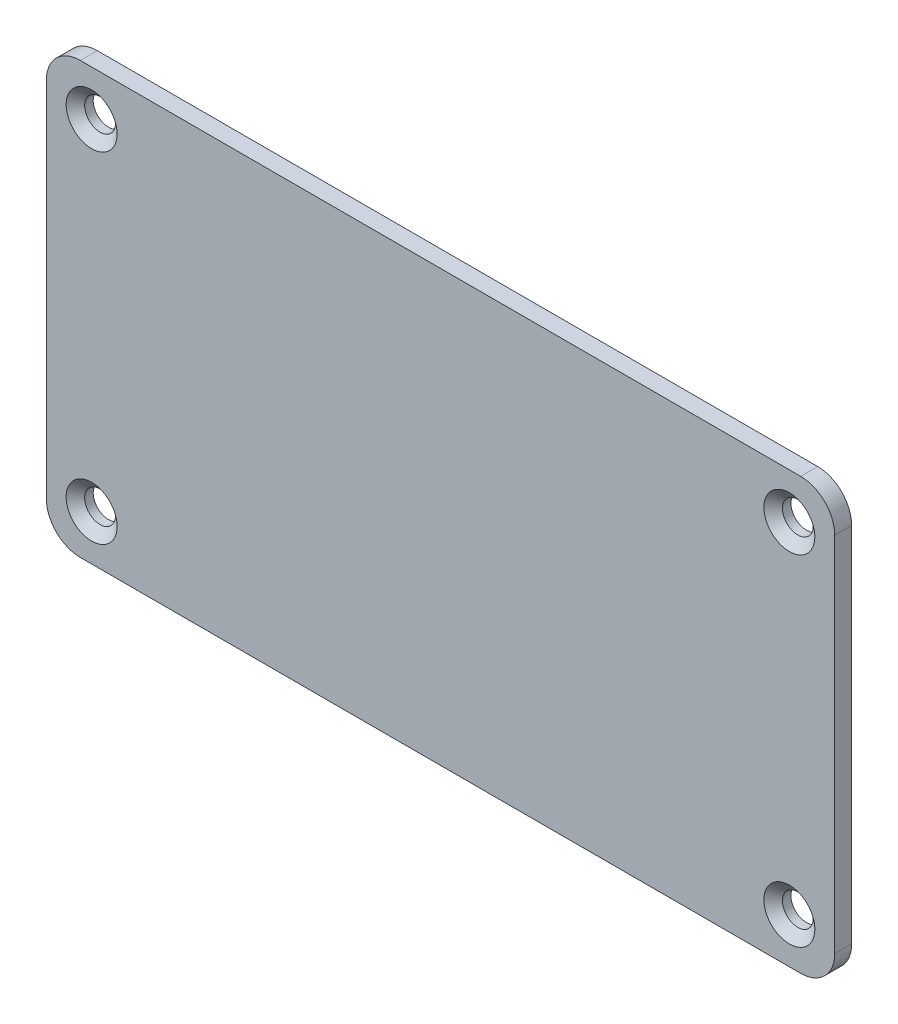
from build123d import *

# Parameters (mm, degrees)
SKETCH1_W                                 = 88.392
SKETCH1_H                                 = 48.26
BOSS_EXTRUDE1_DEPTH                       = 1.905
CSK_FOR_4_FLAT_HEAD_MACHINE_SCREW_2_COUNT = 2
CSK_FOR_4_FLAT_HEAD_MACHINE_SCREW_2_PITCH = 78.232
CSK_FOR_4_FLAT_HEAD_MACHINE_SCREW_3_COUNT = 2
CSK_FOR_4_FLAT_HEAD_MACHINE_SCREW_3_PITCH = 38.1
CSK_FOR_4_FLAT_HEAD_MACHINE_SCREW_4_COUNT = 2
CSK_FOR_4_FLAT_HEAD_MACHINE_SCREW_4_PITCH = 87.016411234
FILLET1_R                                 = 3.81


with BuildPart() as part:
    # Sketch1 → Boss-Extrude1 (new body)
    with BuildSketch(Plane.XY):
        with Locations((0.073386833, -31.43016952)):
            Rectangle(SKETCH1_W, SKETCH1_H)
    extrude(amount=-BOSS_EXTRUDE1_DEPTH)

    # Sketch2 → CSK for _4 Flat Head Machine Screw _100 (revolve, cut)
    with BuildSketch(Plane(origin=(-39.042613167, -12.38016952, 0), x_dir=(0, -1, 0), z_dir=(1, 0, 0))):
        Polygon((0, 0), (0, 1.905), (1.7272, 1.905), (1.7272, 0.948434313), (2.8575, 0), align=None)
    csk_for_4_flat_head_machine_screw_100 = revolve(axis=Axis((-39.042613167, -12.38016952, 6.35), (0, 0, -1)), mode=Mode.SUBTRACT)

    # CSK for _4 Flat Head Machine Screw _ 2: CSK for _4 Flat Head Machine Screw _100 ×2
    with Locations(*[(i * CSK_FOR_4_FLAT_HEAD_MACHINE_SCREW_2_PITCH, 0, 0) for i in range(1, CSK_FOR_4_FLAT_HEAD_MACHINE_SCREW_2_COUNT)]):
        add(csk_for_4_flat_head_machine_screw_100, mode=Mode.SUBTRACT)

    # CSK for _4 Flat Head Machine Screw _ 3: CSK for _4 Flat Head Machine Screw _100 ×2
    with Locations(*[(0, -i * CSK_FOR_4_FLAT_HEAD_MACHINE_SCREW_3_PITCH, 0) for i in range(1, CSK_FOR_4_FLAT_HEAD_MACHINE_SCREW_3_COUNT)]):
        add(csk_for_4_flat_head_machine_screw_100, mode=Mode.SUBTRACT)

    # CSK for _4 Flat Head Machine Screw _ 4: CSK for _4 Flat Head Machine Screw _100 ×2
    with Locations(*[Vector(0.899048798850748, -0.43784844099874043, 0) * (i * CSK_FOR_4_FLAT_HEAD_MACHINE_SCREW_4_PITCH) for i in range(1, CSK_FOR_4_FLAT_HEAD_MACHINE_SCREW_4_COUNT)]):
        add(csk_for_4_flat_head_machine_screw_100, mode=Mode.SUBTRACT)

    # Fillet1
    fillet1_edges = [part.edges().sort_by_distance(p)[0] for p in [
        (-44.122613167, -7.30016952, -0.9525),
        (-44.122613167, -55.56016952, -0.9525),
        (44.269386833, -55.56016952, -0.9525),
        (44.269386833, -7.30016952, -0.9525),
    ]]
    fillet(fillet1_edges, radius=FILLET1_R)


solid = part.part
